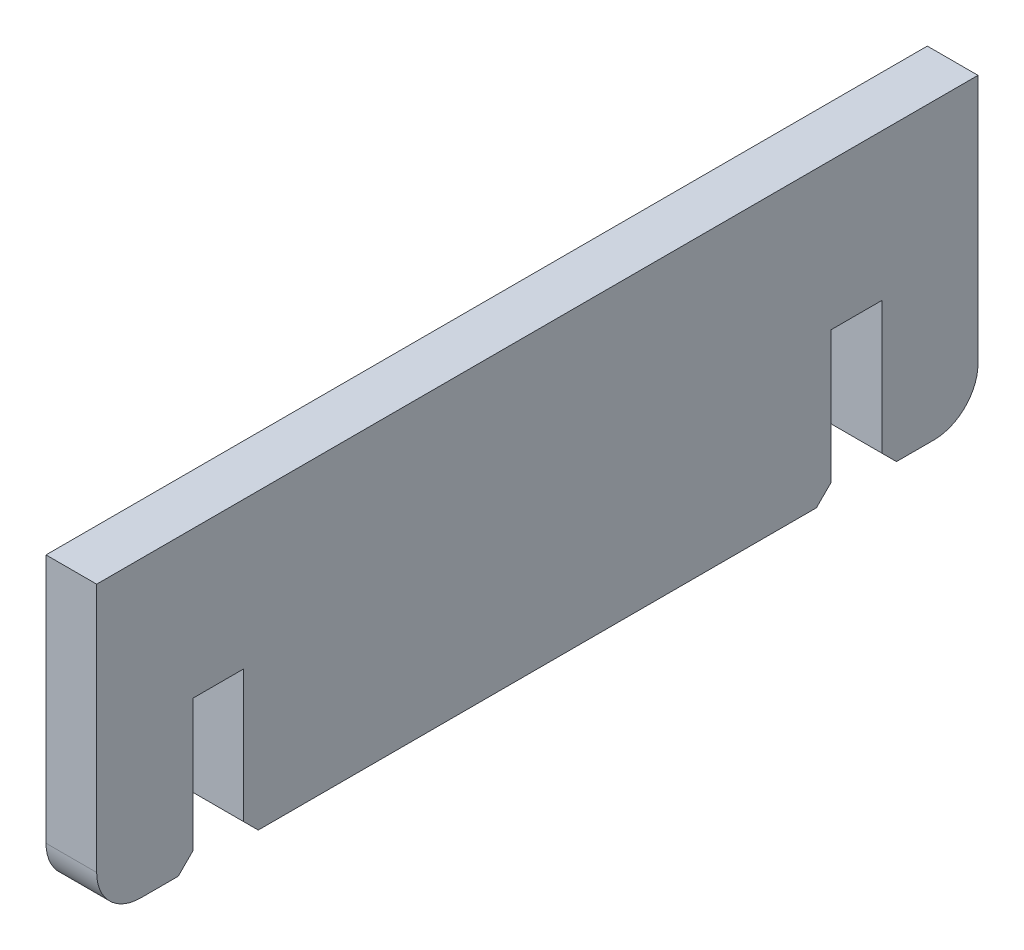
ISO-10303-21;
HEADER;
FILE_DESCRIPTION(('STEP AP214'),'2;1');
FILE_NAME('part.step','',(''),(''),'','','');
FILE_SCHEMA(('AUTOMOTIVE_DESIGN { 1 0 10303 214 1 1 1 1 }'));
ENDSEC;
DATA;
#1=APPLICATION_CONTEXT('core data for automotive mechanical design processes');
#2=APPLICATION_PROTOCOL_DEFINITION('international standard','automotive_design',2000,#1);
#3=PRODUCT_CONTEXT('',#1,'mechanical');
#4=PRODUCT('Part','Part','',(#3));
#5=PRODUCT_RELATED_PRODUCT_CATEGORY('part','',(#4));
#6=PRODUCT_DEFINITION_FORMATION('','',#4);
#7=PRODUCT_DEFINITION_CONTEXT('part definition',#1,'design');
#8=PRODUCT_DEFINITION('design','',#6,#7);
#9=PRODUCT_DEFINITION_SHAPE('','',#8);
#10=(LENGTH_UNIT() NAMED_UNIT(*) SI_UNIT(.MILLI.,.METRE.));
#11=(NAMED_UNIT(*) PLANE_ANGLE_UNIT() SI_UNIT($,.RADIAN.));
#12=(NAMED_UNIT(*) SI_UNIT($,.STERADIAN.) SOLID_ANGLE_UNIT());
#13=UNCERTAINTY_MEASURE_WITH_UNIT(LENGTH_MEASURE(1.E-05),#10,'distance_accuracy_value','');
#14=(GEOMETRIC_REPRESENTATION_CONTEXT(3) GLOBAL_UNCERTAINTY_ASSIGNED_CONTEXT((#13)) GLOBAL_UNIT_ASSIGNED_CONTEXT((#10,
#11,#12)) REPRESENTATION_CONTEXT('',''));
#15=CARTESIAN_POINT('',(0.,0.,0.));
#16=DIRECTION('',(0.,0.,1.));
#17=DIRECTION('',(1.,0.,0.));
#18=AXIS2_PLACEMENT_3D('',#15,#16,#17);
#19=CARTESIAN_POINT('',(17.25,-50.,150.));
#20=DIRECTION('',(0.,1.,0.));
#21=DIRECTION('',(0.,0.,1.));
#22=AXIS2_PLACEMENT_3D('',#19,#20,#21);
#23=PLANE('',#22);
#24=DIRECTION('',(0.,0.,-1.));
#25=VECTOR('',#24,1.);
#26=CARTESIAN_POINT('',(0.,-50.,150.));
#27=LINE('',#26,#25);
#28=CARTESIAN_POINT('',(0.,-50.,95.));
#29=VERTEX_POINT('',#28);
#30=CARTESIAN_POINT('',(0.,-50.,-95.0000000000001));
#31=VERTEX_POINT('',#30);
#32=EDGE_CURVE('E236',#29,#31,#27,.T.);
#33=ORIENTED_EDGE('',*,*,#32,.T.);
#34=DIRECTION('',(1.,0.,0.));
#35=VECTOR('',#34,1.);
#36=CARTESIAN_POINT('',(17.25,-50.,-95.));
#37=LINE('',#36,#35);
#38=CARTESIAN_POINT('',(17.25,-50.,-95.));
#39=VERTEX_POINT('',#38);
#40=EDGE_CURVE('E284',#31,#39,#37,.T.);
#41=ORIENTED_EDGE('',*,*,#40,.T.);
#42=DIRECTION('',(0.,0.,-1.));
#43=VECTOR('',#42,1.);
#44=CARTESIAN_POINT('',(17.25,-50.,150.));
#45=LINE('',#44,#43);
#46=CARTESIAN_POINT('',(17.25,-50.,95.));
#47=VERTEX_POINT('',#46);
#48=EDGE_CURVE('E227',#47,#39,#45,.T.);
#49=ORIENTED_EDGE('',*,*,#48,.F.);
#50=DIRECTION('',(-1.,0.,0.));
#51=VECTOR('',#50,1.);
#52=CARTESIAN_POINT('',(17.25,-50.,95.));
#53=LINE('',#52,#51);
#54=EDGE_CURVE('E282',#47,#29,#53,.T.);
#55=ORIENTED_EDGE('',*,*,#54,.T.);
#56=EDGE_LOOP('',(#33,#41,#49,#55));
#57=FACE_BOUND('',#56,.T.);
#58=ADVANCED_FACE('F33',(#57),#23,.F.);
#59=CARTESIAN_POINT('',(17.25,-50.,-122.25));
#60=VERTEX_POINT('',#59);
#61=CARTESIAN_POINT('',(17.25,-50.,-135.));
#62=VERTEX_POINT('',#61);
#63=EDGE_CURVE('E222',#60,#62,#45,.T.);
#64=ORIENTED_EDGE('',*,*,#63,.F.);
#65=DIRECTION('',(-1.,0.,0.));
#66=VECTOR('',#65,1.);
#67=CARTESIAN_POINT('',(0.,-50.,-122.25));
#68=LINE('',#67,#66);
#69=CARTESIAN_POINT('',(0.,-50.,-122.25));
#70=VERTEX_POINT('',#69);
#71=EDGE_CURVE('E273',#60,#70,#68,.T.);
#72=ORIENTED_EDGE('',*,*,#71,.T.);
#73=CARTESIAN_POINT('',(0.,-50.,-135.));
#74=VERTEX_POINT('',#73);
#75=EDGE_CURVE('E234',#70,#74,#27,.T.);
#76=ORIENTED_EDGE('',*,*,#75,.T.);
#77=DIRECTION('',(-1.,0.,0.));
#78=VECTOR('',#77,1.);
#79=CARTESIAN_POINT('',(17.25,-50.,-135.));
#80=LINE('',#79,#78);
#81=EDGE_CURVE('E250',#74,#62,#80,.F.);
#82=ORIENTED_EDGE('',*,*,#81,.T.);
#83=EDGE_LOOP('',(#64,#72,#76,#82));
#84=FACE_BOUND('',#83,.T.);
#85=ADVANCED_FACE('F324',(#84),#23,.F.);
#86=CARTESIAN_POINT('',(17.25,0.,0.));
#87=DIRECTION('',(-1.,0.,0.));
#88=DIRECTION('',(0.,0.,1.));
#89=AXIS2_PLACEMENT_3D('',#86,#87,#88);
#90=PLANE('',#89);
#91=DIRECTION('',(0.,-1.,0.));
#92=VECTOR('',#91,1.);
#93=CARTESIAN_POINT('',(17.25,0.,-117.25));
#94=LINE('',#93,#92);
#95=CARTESIAN_POINT('',(17.25,0.,-117.25));
#96=VERTEX_POINT('',#95);
#97=CARTESIAN_POINT('',(17.25,-45.,-117.25));
#98=VERTEX_POINT('',#97);
#99=EDGE_CURVE('E170',#96,#98,#94,.T.);
#100=ORIENTED_EDGE('',*,*,#99,.T.);
#101=DIRECTION('',(0.,-0.707106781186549,-0.707106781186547));
#102=VECTOR('',#101,1.);
#103=CARTESIAN_POINT('',(17.25,-45.,-117.25));
#104=LINE('',#103,#102);
#105=EDGE_CURVE('E271',#98,#60,#104,.T.);
#106=ORIENTED_EDGE('',*,*,#105,.T.);
#107=ORIENTED_EDGE('',*,*,#63,.T.);
#108=CARTESIAN_POINT('',(17.25,-35.,-135.));
#109=DIRECTION('',(-1.,0.,0.));
#110=DIRECTION('',(0.,0.,1.));
#111=AXIS2_PLACEMENT_3D('',#108,#109,#110);
#112=CIRCLE('',#111,15.);
#113=CARTESIAN_POINT('',(17.25,-35.,-150.));
#114=VERTEX_POINT('',#113);
#115=EDGE_CURVE('E255',#62,#114,#112,.F.);
#116=ORIENTED_EDGE('',*,*,#115,.T.);
#117=DIRECTION('',(0.,1.,0.));
#118=VECTOR('',#117,1.);
#119=CARTESIAN_POINT('',(17.25,-50.,-150.));
#120=LINE('',#119,#118);
#121=CARTESIAN_POINT('',(17.25,50.,-150.));
#122=VERTEX_POINT('',#121);
#123=EDGE_CURVE('E214',#114,#122,#120,.T.);
#124=ORIENTED_EDGE('',*,*,#123,.T.);
#125=DIRECTION('',(0.,0.,1.));
#126=VECTOR('',#125,1.);
#127=CARTESIAN_POINT('',(17.25,50.,150.));
#128=LINE('',#127,#126);
#129=CARTESIAN_POINT('',(17.25,50.,150.));
#130=VERTEX_POINT('',#129);
#131=EDGE_CURVE('E216',#122,#130,#128,.T.);
#132=ORIENTED_EDGE('',*,*,#131,.T.);
#133=DIRECTION('',(0.,-1.,0.));
#134=VECTOR('',#133,1.);
#135=CARTESIAN_POINT('',(17.25,-50.,150.));
#136=LINE('',#135,#134);
#137=CARTESIAN_POINT('',(17.25,-35.,150.));
#138=VERTEX_POINT('',#137);
#139=EDGE_CURVE('E219',#130,#138,#136,.T.);
#140=ORIENTED_EDGE('',*,*,#139,.T.);
#141=CARTESIAN_POINT('',(17.25,-35.,135.));
#142=DIRECTION('',(-1.,0.,0.));
#143=DIRECTION('',(0.,0.,1.));
#144=AXIS2_PLACEMENT_3D('',#141,#142,#143);
#145=CIRCLE('',#144,15.);
#146=CARTESIAN_POINT('',(17.25,-50.,135.));
#147=VERTEX_POINT('',#146);
#148=EDGE_CURVE('E253',#138,#147,#145,.F.);
#149=ORIENTED_EDGE('',*,*,#148,.T.);
#150=CARTESIAN_POINT('',(17.25,-50.,122.25));
#151=VERTEX_POINT('',#150);
#152=EDGE_CURVE('E223',#147,#151,#45,.T.);
#153=ORIENTED_EDGE('',*,*,#152,.T.);
#154=DIRECTION('',(0.,-0.707106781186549,0.707106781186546));
#155=VECTOR('',#154,1.);
#156=CARTESIAN_POINT('',(17.25,-50.,122.25));
#157=LINE('',#156,#155);
#158=CARTESIAN_POINT('',(17.25,-45.,117.25));
#159=VERTEX_POINT('',#158);
#160=EDGE_CURVE('E267',#151,#159,#157,.F.);
#161=ORIENTED_EDGE('',*,*,#160,.T.);
#162=DIRECTION('',(0.,-1.,0.));
#163=VECTOR('',#162,1.);
#164=CARTESIAN_POINT('',(17.25,0.,117.25));
#165=LINE('',#164,#163);
#166=CARTESIAN_POINT('',(17.25,0.,117.25));
#167=VERTEX_POINT('',#166);
#168=EDGE_CURVE('E179',#167,#159,#165,.T.);
#169=ORIENTED_EDGE('',*,*,#168,.F.);
#170=DIRECTION('',(0.,0.,1.));
#171=VECTOR('',#170,1.);
#172=CARTESIAN_POINT('',(17.25,0.,0.));
#173=LINE('',#172,#171);
#174=CARTESIAN_POINT('',(17.25,0.,100.));
#175=VERTEX_POINT('',#174);
#176=EDGE_CURVE('E198',#175,#167,#173,.T.);
#177=ORIENTED_EDGE('',*,*,#176,.F.);
#178=DIRECTION('',(0.,1.,0.));
#179=VECTOR('',#178,1.);
#180=CARTESIAN_POINT('',(17.25,0.,100.));
#181=LINE('',#180,#179);
#182=CARTESIAN_POINT('',(17.25,-45.,100.));
#183=VERTEX_POINT('',#182);
#184=EDGE_CURVE('E205',#183,#175,#181,.T.);
#185=ORIENTED_EDGE('',*,*,#184,.F.);
#186=DIRECTION('',(0.,0.707106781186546,0.707106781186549));
#187=VECTOR('',#186,1.);
#188=CARTESIAN_POINT('',(17.25,-45.,100.));
#189=LINE('',#188,#187);
#190=EDGE_CURVE('E265',#183,#47,#189,.F.);
#191=ORIENTED_EDGE('',*,*,#190,.T.);
#192=ORIENTED_EDGE('',*,*,#48,.T.);
#193=DIRECTION('',(0.,0.707106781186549,-0.707106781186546));
#194=VECTOR('',#193,1.);
#195=CARTESIAN_POINT('',(17.25,-50.,-95.));
#196=LINE('',#195,#194);
#197=CARTESIAN_POINT('',(17.25,-45.,-100.));
#198=VERTEX_POINT('',#197);
#199=EDGE_CURVE('E269',#39,#198,#196,.T.);
#200=ORIENTED_EDGE('',*,*,#199,.T.);
#201=DIRECTION('',(0.,1.,0.));
#202=VECTOR('',#201,1.);
#203=CARTESIAN_POINT('',(17.25,0.,-100.));
#204=LINE('',#203,#202);
#205=CARTESIAN_POINT('',(17.25,0.,-100.));
#206=VERTEX_POINT('',#205);
#207=EDGE_CURVE('E189',#198,#206,#204,.T.);
#208=ORIENTED_EDGE('',*,*,#207,.T.);
#209=DIRECTION('',(0.,0.,-1.));
#210=VECTOR('',#209,1.);
#211=CARTESIAN_POINT('',(17.25,0.,0.));
#212=LINE('',#211,#210);
#213=EDGE_CURVE('E178',#206,#96,#212,.T.);
#214=ORIENTED_EDGE('',*,*,#213,.T.);
#215=EDGE_LOOP('',(#100,#106,#107,#116,#124,#132,#140,#149,#153,#161,#169,#177,#185,#191,#192,
#200,#208,#214));
#216=FACE_BOUND('',#215,.T.);
#217=ADVANCED_FACE('F297',(#216),#90,.F.);
#218=CARTESIAN_POINT('',(0.,0.,0.));
#219=DIRECTION('',(-1.,0.,0.));
#220=DIRECTION('',(0.,0.,1.));
#221=AXIS2_PLACEMENT_3D('',#218,#219,#220);
#222=PLANE('',#221);
#223=ORIENTED_EDGE('',*,*,#75,.F.);
#224=DIRECTION('',(0.,0.707106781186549,0.707106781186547));
#225=VECTOR('',#224,1.);
#226=CARTESIAN_POINT('',(0.,36.1250000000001,-36.1250000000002));
#227=LINE('',#226,#225);
#228=CARTESIAN_POINT('',(0.,-45.,-117.25));
#229=VERTEX_POINT('',#228);
#230=EDGE_CURVE('E280',#70,#229,#227,.T.);
#231=ORIENTED_EDGE('',*,*,#230,.T.);
#232=DIRECTION('',(0.,-1.,0.));
#233=VECTOR('',#232,1.);
#234=CARTESIAN_POINT('',(0.,0.,-117.25));
#235=LINE('',#234,#233);
#236=CARTESIAN_POINT('',(0.,0.,-117.25));
#237=VERTEX_POINT('',#236);
#238=EDGE_CURVE('E185',#237,#229,#235,.T.);
#239=ORIENTED_EDGE('',*,*,#238,.F.);
#240=DIRECTION('',(0.,0.,-1.));
#241=VECTOR('',#240,1.);
#242=CARTESIAN_POINT('',(0.,0.,0.));
#243=LINE('',#242,#241);
#244=CARTESIAN_POINT('',(0.,0.,-100.));
#245=VERTEX_POINT('',#244);
#246=EDGE_CURVE('E169',#245,#237,#243,.T.);
#247=ORIENTED_EDGE('',*,*,#246,.F.);
#248=DIRECTION('',(0.,1.,0.));
#249=VECTOR('',#248,1.);
#250=CARTESIAN_POINT('',(0.,0.,-100.));
#251=LINE('',#250,#249);
#252=CARTESIAN_POINT('',(0.,-45.,-100.));
#253=VERTEX_POINT('',#252);
#254=EDGE_CURVE('E160',#253,#245,#251,.T.);
#255=ORIENTED_EDGE('',*,*,#254,.F.);
#256=DIRECTION('',(0.,-0.707106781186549,0.707106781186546));
#257=VECTOR('',#256,1.);
#258=CARTESIAN_POINT('',(0.,-72.4999999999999,-72.5000000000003));
#259=LINE('',#258,#257);
#260=EDGE_CURVE('E278',#253,#31,#259,.T.);
#261=ORIENTED_EDGE('',*,*,#260,.T.);
#262=ORIENTED_EDGE('',*,*,#32,.F.);
#263=DIRECTION('',(0.,-0.707106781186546,-0.707106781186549));
#264=VECTOR('',#263,1.);
#265=CARTESIAN_POINT('',(0.,-72.5000000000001,72.4999999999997));
#266=LINE('',#265,#264);
#267=CARTESIAN_POINT('',(0.,-45.,100.));
#268=VERTEX_POINT('',#267);
#269=EDGE_CURVE('E275',#29,#268,#266,.F.);
#270=ORIENTED_EDGE('',*,*,#269,.T.);
#271=DIRECTION('',(0.,1.,0.));
#272=VECTOR('',#271,1.);
#273=CARTESIAN_POINT('',(0.,0.,100.));
#274=LINE('',#273,#272);
#275=CARTESIAN_POINT('',(0.,0.,100.));
#276=VERTEX_POINT('',#275);
#277=EDGE_CURVE('E197',#268,#276,#274,.T.);
#278=ORIENTED_EDGE('',*,*,#277,.T.);
#279=DIRECTION('',(0.,0.,1.));
#280=VECTOR('',#279,1.);
#281=CARTESIAN_POINT('',(0.,0.,0.));
#282=LINE('',#281,#280);
#283=CARTESIAN_POINT('',(0.,0.,117.25));
#284=VERTEX_POINT('',#283);
#285=EDGE_CURVE('E200',#276,#284,#282,.T.);
#286=ORIENTED_EDGE('',*,*,#285,.T.);
#287=DIRECTION('',(0.,-1.,0.));
#288=VECTOR('',#287,1.);
#289=CARTESIAN_POINT('',(0.,0.,117.25));
#290=LINE('',#289,#288);
#291=CARTESIAN_POINT('',(0.,-45.,117.25));
#292=VERTEX_POINT('',#291);
#293=EDGE_CURVE('E195',#284,#292,#290,.T.);
#294=ORIENTED_EDGE('',*,*,#293,.T.);
#295=DIRECTION('',(0.,0.707106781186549,-0.707106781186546));
#296=VECTOR('',#295,1.);
#297=CARTESIAN_POINT('',(0.,36.1250000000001,36.1250000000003));
#298=LINE('',#297,#296);
#299=CARTESIAN_POINT('',(0.,-50.,122.25));
#300=VERTEX_POINT('',#299);
#301=EDGE_CURVE('E48',#292,#300,#298,.F.);
#302=ORIENTED_EDGE('',*,*,#301,.T.);
#303=CARTESIAN_POINT('',(0.,-50.,135.));
#304=VERTEX_POINT('',#303);
#305=EDGE_CURVE('E217',#304,#300,#27,.T.);
#306=ORIENTED_EDGE('',*,*,#305,.F.);
#307=CARTESIAN_POINT('',(0.,-35.,135.));
#308=DIRECTION('',(-1.,0.,0.));
#309=DIRECTION('',(0.,0.,1.));
#310=AXIS2_PLACEMENT_3D('',#307,#308,#309);
#311=CIRCLE('',#310,15.);
#312=CARTESIAN_POINT('',(0.,-35.,150.));
#313=VERTEX_POINT('',#312);
#314=EDGE_CURVE('E245',#304,#313,#311,.T.);
#315=ORIENTED_EDGE('',*,*,#314,.T.);
#316=DIRECTION('',(0.,-1.,0.));
#317=VECTOR('',#316,1.);
#318=CARTESIAN_POINT('',(0.,-50.,150.));
#319=LINE('',#318,#317);
#320=CARTESIAN_POINT('',(0.,50.,150.));
#321=VERTEX_POINT('',#320);
#322=EDGE_CURVE('E231',#321,#313,#319,.T.);
#323=ORIENTED_EDGE('',*,*,#322,.F.);
#324=DIRECTION('',(0.,0.,1.));
#325=VECTOR('',#324,1.);
#326=CARTESIAN_POINT('',(0.,50.,150.));
#327=LINE('',#326,#325);
#328=CARTESIAN_POINT('',(0.,50.,-150.));
#329=VERTEX_POINT('',#328);
#330=EDGE_CURVE('E229',#329,#321,#327,.T.);
#331=ORIENTED_EDGE('',*,*,#330,.F.);
#332=DIRECTION('',(0.,1.,0.));
#333=VECTOR('',#332,1.);
#334=CARTESIAN_POINT('',(0.,-50.,-150.));
#335=LINE('',#334,#333);
#336=CARTESIAN_POINT('',(0.,-35.,-150.));
#337=VERTEX_POINT('',#336);
#338=EDGE_CURVE('E211',#337,#329,#335,.T.);
#339=ORIENTED_EDGE('',*,*,#338,.F.);
#340=CARTESIAN_POINT('',(0.,-35.,-135.));
#341=DIRECTION('',(-1.,0.,0.));
#342=DIRECTION('',(0.,0.,1.));
#343=AXIS2_PLACEMENT_3D('',#340,#341,#342);
#344=CIRCLE('',#343,15.);
#345=EDGE_CURVE('E247',#337,#74,#344,.T.);
#346=ORIENTED_EDGE('',*,*,#345,.T.);
#347=EDGE_LOOP('',(#223,#231,#239,#247,#255,#261,#262,#270,#278,#286,#294,#302,#306,#315,#323,
#331,#339,#346));
#348=FACE_BOUND('',#347,.T.);
#349=ADVANCED_FACE('F183',(#348),#222,.T.);
#350=ORIENTED_EDGE('',*,*,#305,.T.);
#351=DIRECTION('',(1.,0.,0.));
#352=VECTOR('',#351,1.);
#353=CARTESIAN_POINT('',(17.25,-50.,122.25));
#354=LINE('',#353,#352);
#355=EDGE_CURVE('E288',#300,#151,#354,.T.);
#356=ORIENTED_EDGE('',*,*,#355,.T.);
#357=ORIENTED_EDGE('',*,*,#152,.F.);
#358=DIRECTION('',(-1.,0.,0.));
#359=VECTOR('',#358,1.);
#360=CARTESIAN_POINT('',(17.25,-50.,135.));
#361=LINE('',#360,#359);
#362=EDGE_CURVE('E257',#147,#304,#361,.T.);
#363=ORIENTED_EDGE('',*,*,#362,.T.);
#364=EDGE_LOOP('',(#350,#356,#357,#363));
#365=FACE_BOUND('',#364,.T.);
#366=ADVANCED_FACE('F293',(#365),#23,.F.);
#367=CARTESIAN_POINT('',(17.25,-50.,-150.));
#368=DIRECTION('',(0.,0.,1.));
#369=DIRECTION('',(1.,0.,0.));
#370=AXIS2_PLACEMENT_3D('',#367,#368,#369);
#371=PLANE('',#370);
#372=ORIENTED_EDGE('',*,*,#123,.F.);
#373=DIRECTION('',(-1.,0.,0.));
#374=VECTOR('',#373,1.);
#375=CARTESIAN_POINT('',(17.25,-35.,-150.));
#376=LINE('',#375,#374);
#377=EDGE_CURVE('E242',#114,#337,#376,.T.);
#378=ORIENTED_EDGE('',*,*,#377,.T.);
#379=ORIENTED_EDGE('',*,*,#338,.T.);
#380=DIRECTION('',(-1.,0.,0.));
#381=VECTOR('',#380,1.);
#382=CARTESIAN_POINT('',(17.25,50.,-150.));
#383=LINE('',#382,#381);
#384=EDGE_CURVE('E239',#122,#329,#383,.T.);
#385=ORIENTED_EDGE('',*,*,#384,.F.);
#386=EDGE_LOOP('',(#372,#378,#379,#385));
#387=FACE_BOUND('',#386,.T.);
#388=ADVANCED_FACE('F317',(#387),#371,.F.);
#389=CARTESIAN_POINT('',(17.25,50.,150.));
#390=DIRECTION('',(0.,-1.,0.));
#391=DIRECTION('',(0.,0.,-1.));
#392=AXIS2_PLACEMENT_3D('',#389,#390,#391);
#393=PLANE('',#392);
#394=ORIENTED_EDGE('',*,*,#330,.T.);
#395=DIRECTION('',(-1.,0.,0.));
#396=VECTOR('',#395,1.);
#397=CARTESIAN_POINT('',(17.25,50.,150.));
#398=LINE('',#397,#396);
#399=EDGE_CURVE('E226',#130,#321,#398,.T.);
#400=ORIENTED_EDGE('',*,*,#399,.F.);
#401=ORIENTED_EDGE('',*,*,#131,.F.);
#402=ORIENTED_EDGE('',*,*,#384,.T.);
#403=EDGE_LOOP('',(#394,#400,#401,#402));
#404=FACE_BOUND('',#403,.T.);
#405=ADVANCED_FACE('F311',(#404),#393,.F.);
#406=CARTESIAN_POINT('',(17.25,-50.,150.));
#407=DIRECTION('',(0.,0.,-1.));
#408=DIRECTION('',(-1.,0.,0.));
#409=AXIS2_PLACEMENT_3D('',#406,#407,#408);
#410=PLANE('',#409);
#411=ORIENTED_EDGE('',*,*,#322,.T.);
#412=DIRECTION('',(-1.,0.,0.));
#413=VECTOR('',#412,1.);
#414=CARTESIAN_POINT('',(17.25,-35.,150.));
#415=LINE('',#414,#413);
#416=EDGE_CURVE('E260',#313,#138,#415,.F.);
#417=ORIENTED_EDGE('',*,*,#416,.T.);
#418=ORIENTED_EDGE('',*,*,#139,.F.);
#419=ORIENTED_EDGE('',*,*,#399,.T.);
#420=EDGE_LOOP('',(#411,#417,#418,#419));
#421=FACE_BOUND('',#420,.T.);
#422=ADVANCED_FACE('F307',(#421),#410,.F.);
#423=CARTESIAN_POINT('',(0.,0.,117.25));
#424=DIRECTION('',(0.,0.,1.));
#425=DIRECTION('',(1.,0.,0.));
#426=AXIS2_PLACEMENT_3D('',#423,#424,#425);
#427=PLANE('',#426);
#428=ORIENTED_EDGE('',*,*,#168,.T.);
#429=DIRECTION('',(-1.,0.,0.));
#430=VECTOR('',#429,1.);
#431=CARTESIAN_POINT('',(0.,-45.,117.25));
#432=LINE('',#431,#430);
#433=EDGE_CURVE('E41',#159,#292,#432,.T.);
#434=ORIENTED_EDGE('',*,*,#433,.T.);
#435=ORIENTED_EDGE('',*,*,#293,.F.);
#436=DIRECTION('',(1.,0.,0.));
#437=VECTOR('',#436,1.);
#438=CARTESIAN_POINT('',(0.,0.,117.25));
#439=LINE('',#438,#437);
#440=EDGE_CURVE('E209',#284,#167,#439,.T.);
#441=ORIENTED_EDGE('',*,*,#440,.T.);
#442=EDGE_LOOP('',(#428,#434,#435,#441));
#443=FACE_BOUND('',#442,.T.);
#444=ADVANCED_FACE('F370',(#443),#427,.F.);
#445=CARTESIAN_POINT('',(0.,0.,0.));
#446=DIRECTION('',(0.,1.,0.));
#447=DIRECTION('',(0.,0.,1.));
#448=AXIS2_PLACEMENT_3D('',#445,#446,#447);
#449=PLANE('',#448);
#450=ORIENTED_EDGE('',*,*,#176,.T.);
#451=ORIENTED_EDGE('',*,*,#440,.F.);
#452=ORIENTED_EDGE('',*,*,#285,.F.);
#453=DIRECTION('',(1.,0.,0.));
#454=VECTOR('',#453,1.);
#455=CARTESIAN_POINT('',(0.,0.,100.));
#456=LINE('',#455,#454);
#457=EDGE_CURVE('E203',#276,#175,#456,.T.);
#458=ORIENTED_EDGE('',*,*,#457,.T.);
#459=EDGE_LOOP('',(#450,#451,#452,#458));
#460=FACE_BOUND('',#459,.T.);
#461=ADVANCED_FACE('F373',(#460),#449,.F.);
#462=CARTESIAN_POINT('',(0.,0.,100.));
#463=DIRECTION('',(0.,0.,-1.));
#464=DIRECTION('',(-1.,0.,0.));
#465=AXIS2_PLACEMENT_3D('',#462,#463,#464);
#466=PLANE('',#465);
#467=ORIENTED_EDGE('',*,*,#277,.F.);
#468=DIRECTION('',(1.,0.,0.));
#469=VECTOR('',#468,1.);
#470=CARTESIAN_POINT('',(0.,-45.,100.));
#471=LINE('',#470,#469);
#472=EDGE_CURVE('E11',#268,#183,#471,.T.);
#473=ORIENTED_EDGE('',*,*,#472,.T.);
#474=ORIENTED_EDGE('',*,*,#184,.T.);
#475=ORIENTED_EDGE('',*,*,#457,.F.);
#476=EDGE_LOOP('',(#467,#473,#474,#475));
#477=FACE_BOUND('',#476,.T.);
#478=ADVANCED_FACE('F374',(#477),#466,.F.);
#479=CARTESIAN_POINT('',(0.,0.,-100.));
#480=DIRECTION('',(0.,0.,-1.));
#481=DIRECTION('',(-1.,0.,0.));
#482=AXIS2_PLACEMENT_3D('',#479,#480,#481);
#483=PLANE('',#482);
#484=ORIENTED_EDGE('',*,*,#207,.F.);
#485=DIRECTION('',(-1.,0.,0.));
#486=VECTOR('',#485,1.);
#487=CARTESIAN_POINT('',(0.,-45.,-100.));
#488=LINE('',#487,#486);
#489=EDGE_CURVE('E166',#198,#253,#488,.T.);
#490=ORIENTED_EDGE('',*,*,#489,.T.);
#491=ORIENTED_EDGE('',*,*,#254,.T.);
#492=DIRECTION('',(1.,0.,0.));
#493=VECTOR('',#492,1.);
#494=CARTESIAN_POINT('',(0.,0.,-100.));
#495=LINE('',#494,#493);
#496=EDGE_CURVE('E164',#245,#206,#495,.T.);
#497=ORIENTED_EDGE('',*,*,#496,.T.);
#498=EDGE_LOOP('',(#484,#490,#491,#497));
#499=FACE_BOUND('',#498,.T.);
#500=ADVANCED_FACE('F163',(#499),#483,.T.);
#501=CARTESIAN_POINT('',(0.,0.,0.));
#502=DIRECTION('',(0.,-1.,0.));
#503=DIRECTION('',(0.,0.,-1.));
#504=AXIS2_PLACEMENT_3D('',#501,#502,#503);
#505=PLANE('',#504);
#506=ORIENTED_EDGE('',*,*,#213,.F.);
#507=ORIENTED_EDGE('',*,*,#496,.F.);
#508=ORIENTED_EDGE('',*,*,#246,.T.);
#509=DIRECTION('',(1.,0.,0.));
#510=VECTOR('',#509,1.);
#511=CARTESIAN_POINT('',(0.,0.,-117.25));
#512=LINE('',#511,#510);
#513=EDGE_CURVE('E180',#237,#96,#512,.T.);
#514=ORIENTED_EDGE('',*,*,#513,.T.);
#515=EDGE_LOOP('',(#506,#507,#508,#514));
#516=FACE_BOUND('',#515,.T.);
#517=ADVANCED_FACE('F175',(#516),#505,.T.);
#518=CARTESIAN_POINT('',(0.,0.,-117.25));
#519=DIRECTION('',(0.,0.,1.));
#520=DIRECTION('',(1.,0.,0.));
#521=AXIS2_PLACEMENT_3D('',#518,#519,#520);
#522=PLANE('',#521);
#523=ORIENTED_EDGE('',*,*,#238,.T.);
#524=DIRECTION('',(1.,0.,0.));
#525=VECTOR('',#524,1.);
#526=CARTESIAN_POINT('',(17.25,-45.,-117.25));
#527=LINE('',#526,#525);
#528=EDGE_CURVE('E262',#229,#98,#527,.T.);
#529=ORIENTED_EDGE('',*,*,#528,.T.);
#530=ORIENTED_EDGE('',*,*,#99,.F.);
#531=ORIENTED_EDGE('',*,*,#513,.F.);
#532=EDGE_LOOP('',(#523,#529,#530,#531));
#533=FACE_BOUND('',#532,.T.);
#534=ADVANCED_FACE('F343',(#533),#522,.T.);
#535=CARTESIAN_POINT('',(17.25,-35.,-135.));
#536=DIRECTION('',(-1.,0.,0.));
#537=DIRECTION('',(0.,0.,1.));
#538=AXIS2_PLACEMENT_3D('',#535,#536,#537);
#539=CYLINDRICAL_SURFACE('',#538,15.);
#540=ORIENTED_EDGE('',*,*,#115,.F.);
#541=ORIENTED_EDGE('',*,*,#81,.F.);
#542=ORIENTED_EDGE('',*,*,#345,.F.);
#543=ORIENTED_EDGE('',*,*,#377,.F.);
#544=EDGE_LOOP('',(#540,#541,#542,#543));
#545=FACE_BOUND('',#544,.T.);
#546=ADVANCED_FACE('F321',(#545),#539,.T.);
#547=CARTESIAN_POINT('',(17.25,-35.,135.));
#548=DIRECTION('',(-1.,0.,0.));
#549=DIRECTION('',(0.,0.,1.));
#550=AXIS2_PLACEMENT_3D('',#547,#548,#549);
#551=CYLINDRICAL_SURFACE('',#550,15.);
#552=ORIENTED_EDGE('',*,*,#148,.F.);
#553=ORIENTED_EDGE('',*,*,#416,.F.);
#554=ORIENTED_EDGE('',*,*,#314,.F.);
#555=ORIENTED_EDGE('',*,*,#362,.F.);
#556=EDGE_LOOP('',(#552,#553,#554,#555));
#557=FACE_BOUND('',#556,.T.);
#558=ADVANCED_FACE('F303',(#557),#551,.T.);
#559=CARTESIAN_POINT('',(0.,-45.,-117.25));
#560=DIRECTION('',(0.,-0.707106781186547,0.707106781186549));
#561=DIRECTION('',(-1.,0.,0.));
#562=AXIS2_PLACEMENT_3D('',#559,#560,#561);
#563=PLANE('',#562);
#564=ORIENTED_EDGE('',*,*,#230,.F.);
#565=ORIENTED_EDGE('',*,*,#71,.F.);
#566=ORIENTED_EDGE('',*,*,#105,.F.);
#567=ORIENTED_EDGE('',*,*,#528,.F.);
#568=EDGE_LOOP('',(#564,#565,#566,#567));
#569=FACE_BOUND('',#568,.T.);
#570=ADVANCED_FACE('F341',(#569),#563,.T.);
#571=CARTESIAN_POINT('',(17.25,-50.,-95.));
#572=DIRECTION('',(0.,-0.707106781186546,-0.707106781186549));
#573=DIRECTION('',(-1.,0.,0.));
#574=AXIS2_PLACEMENT_3D('',#571,#572,#573);
#575=PLANE('',#574);
#576=ORIENTED_EDGE('',*,*,#260,.F.);
#577=ORIENTED_EDGE('',*,*,#489,.F.);
#578=ORIENTED_EDGE('',*,*,#199,.F.);
#579=ORIENTED_EDGE('',*,*,#40,.F.);
#580=EDGE_LOOP('',(#576,#577,#578,#579));
#581=FACE_BOUND('',#580,.T.);
#582=ADVANCED_FACE('F336',(#581),#575,.T.);
#583=CARTESIAN_POINT('',(17.25,-50.,122.25));
#584=DIRECTION('',(0.,0.707106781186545,0.707106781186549));
#585=DIRECTION('',(1.,0.,0.));
#586=AXIS2_PLACEMENT_3D('',#583,#584,#585);
#587=PLANE('',#586);
#588=ORIENTED_EDGE('',*,*,#301,.F.);
#589=ORIENTED_EDGE('',*,*,#433,.F.);
#590=ORIENTED_EDGE('',*,*,#160,.F.);
#591=ORIENTED_EDGE('',*,*,#355,.F.);
#592=EDGE_LOOP('',(#588,#589,#590,#591));
#593=FACE_BOUND('',#592,.T.);
#594=ADVANCED_FACE('F477',(#593),#587,.F.);
#595=CARTESIAN_POINT('',(0.,-45.,100.));
#596=DIRECTION('',(0.,0.707106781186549,-0.707106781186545));
#597=DIRECTION('',(1.,0.,0.));
#598=AXIS2_PLACEMENT_3D('',#595,#596,#597);
#599=PLANE('',#598);
#600=ORIENTED_EDGE('',*,*,#269,.F.);
#601=ORIENTED_EDGE('',*,*,#54,.F.);
#602=ORIENTED_EDGE('',*,*,#190,.F.);
#603=ORIENTED_EDGE('',*,*,#472,.F.);
#604=EDGE_LOOP('',(#600,#601,#602,#603));
#605=FACE_BOUND('',#604,.T.);
#606=ADVANCED_FACE('F35',(#605),#599,.F.);
#607=CLOSED_SHELL('',(#58,#85,#217,#349,#366,#388,#405,#422,#444,#461,#478,#500,#517,#534,#546,
#558,#570,#582,#594,#606));
#608=MANIFOLD_SOLID_BREP('B2',#607);
#609=ADVANCED_BREP_SHAPE_REPRESENTATION('',(#18,#608),#14);
#610=SHAPE_DEFINITION_REPRESENTATION(#9,#609);
ENDSEC;
END-ISO-10303-21;
